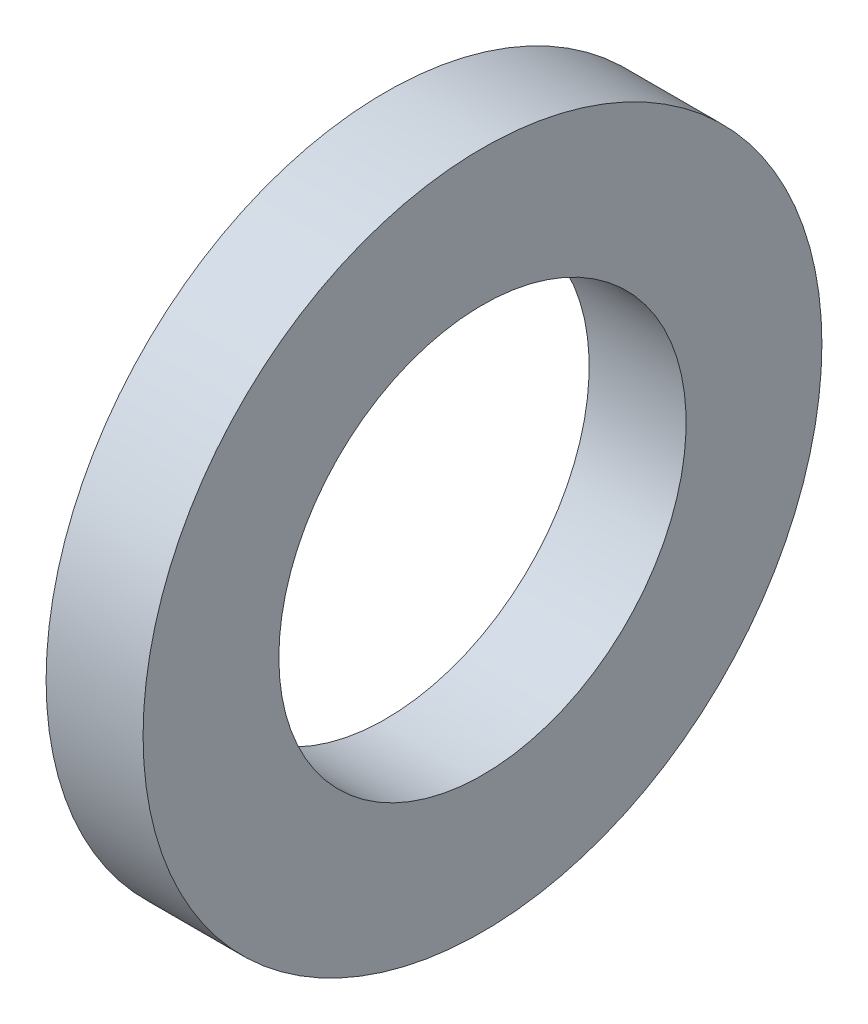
from build123d import *

# Parameters (mm, degrees)
ESQUISSE1_W = 2
ESQUISSE1_H = 2.8


with BuildPart() as part:
    # Esquisse1 → Base-R_volution (revolve)
    with BuildSketch(Plane(origin=(0, 0, 0), x_dir=(1, 0, 0), z_dir=(0, 1, 0)), mode=Mode.PRIVATE) as base_r_volution_sk:
        with Locations((1, 5.6)):
            Rectangle(ESQUISSE1_W, ESQUISSE1_H)
    revolve(base_r_volution_sk.sketch.rotate(Axis((0, 0, 0), (1, 0, 0)), 180), axis=Axis((0, 0, 0), (1, 0, 0)))


solid = part.part
